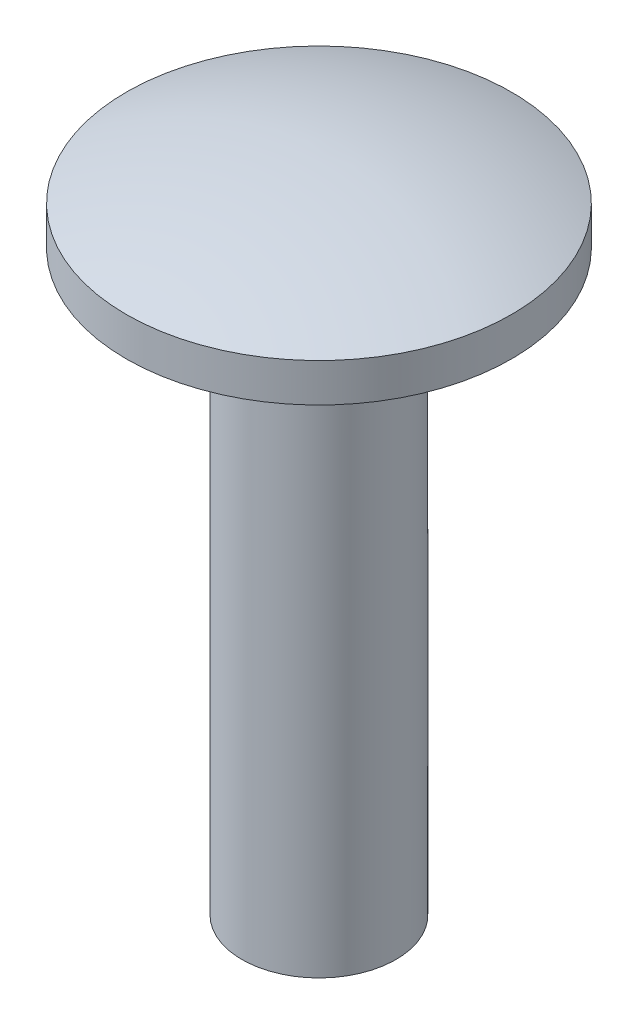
ISO-10303-21;
HEADER;
FILE_DESCRIPTION(('STEP AP214'),'2;1');
FILE_NAME('part.step','',(''),(''),'','','');
FILE_SCHEMA(('AUTOMOTIVE_DESIGN { 1 0 10303 214 1 1 1 1 }'));
ENDSEC;
DATA;
#1=APPLICATION_CONTEXT('core data for automotive mechanical design processes');
#2=APPLICATION_PROTOCOL_DEFINITION('international standard','automotive_design',2000,#1);
#3=PRODUCT_CONTEXT('',#1,'mechanical');
#4=PRODUCT('Part','Part','',(#3));
#5=PRODUCT_RELATED_PRODUCT_CATEGORY('part','',(#4));
#6=PRODUCT_DEFINITION_FORMATION('','',#4);
#7=PRODUCT_DEFINITION_CONTEXT('part definition',#1,'design');
#8=PRODUCT_DEFINITION('design','',#6,#7);
#9=PRODUCT_DEFINITION_SHAPE('','',#8);
#10=(LENGTH_UNIT() NAMED_UNIT(*) SI_UNIT(.MILLI.,.METRE.));
#11=(NAMED_UNIT(*) PLANE_ANGLE_UNIT() SI_UNIT($,.RADIAN.));
#12=(NAMED_UNIT(*) SI_UNIT($,.STERADIAN.) SOLID_ANGLE_UNIT());
#13=UNCERTAINTY_MEASURE_WITH_UNIT(LENGTH_MEASURE(1.E-05),#10,'distance_accuracy_value','');
#14=(GEOMETRIC_REPRESENTATION_CONTEXT(3) GLOBAL_UNCERTAINTY_ASSIGNED_CONTEXT((#13)) GLOBAL_UNIT_ASSIGNED_CONTEXT((#10,
#11,#12)) REPRESENTATION_CONTEXT('',''));
#15=CARTESIAN_POINT('',(0.,0.,0.));
#16=DIRECTION('',(0.,0.,1.));
#17=DIRECTION('',(1.,0.,0.));
#18=AXIS2_PLACEMENT_3D('',#15,#16,#17);
#19=CARTESIAN_POINT('',(0.,0.,0.));
#20=DIRECTION('',(0.,1.,0.));
#21=DIRECTION('',(0.,0.,1.));
#22=AXIS2_PLACEMENT_3D('',#19,#20,#21);
#23=PLANE('',#22);
#24=CARTESIAN_POINT('',(0.,0.,0.));
#25=DIRECTION('',(0.,1.,0.));
#26=DIRECTION('',(0.,0.,1.));
#27=AXIS2_PLACEMENT_3D('',#24,#25,#26);
#28=CIRCLE('',#27,2.);
#29=CARTESIAN_POINT('',(0.,0.,-2.));
#30=VERTEX_POINT('',#29);
#31=CARTESIAN_POINT('',(0.,0.,2.));
#32=VERTEX_POINT('',#31);
#33=EDGE_CURVE('E46',#30,#32,#28,.F.);
#34=ORIENTED_EDGE('',*,*,#33,.F.);
#35=EDGE_CURVE('E11',#32,#30,#28,.F.);
#36=ORIENTED_EDGE('',*,*,#35,.F.);
#37=EDGE_LOOP('',(#34,#36));
#38=FACE_BOUND('',#37,.T.);
#39=CARTESIAN_POINT('',(0.,0.,0.));
#40=DIRECTION('',(0.,1.,0.));
#41=DIRECTION('',(0.,0.,1.));
#42=AXIS2_PLACEMENT_3D('',#39,#40,#41);
#43=CIRCLE('',#42,5.);
#44=CARTESIAN_POINT('',(0.,0.,5.));
#45=VERTEX_POINT('',#44);
#46=EDGE_CURVE('E61',#45,#45,#43,.T.);
#47=ORIENTED_EDGE('',*,*,#46,.F.);
#48=EDGE_LOOP('',(#47));
#49=FACE_BOUND('',#48,.T.);
#50=ADVANCED_FACE('F33',(#38,#49),#23,.F.);
#51=CARTESIAN_POINT('',(0.,1.,0.));
#52=DIRECTION('',(0.,-1.,0.));
#53=DIRECTION('',(0.,0.,-1.));
#54=AXIS2_PLACEMENT_3D('',#51,#52,#53);
#55=CYLINDRICAL_SURFACE('',#54,5.);
#56=CARTESIAN_POINT('',(0.,1.,0.));
#57=DIRECTION('',(0.,1.,0.));
#58=DIRECTION('',(0.,0.,1.));
#59=AXIS2_PLACEMENT_3D('',#56,#57,#58);
#60=CIRCLE('',#59,5.);
#61=CARTESIAN_POINT('',(0.,1.,5.));
#62=VERTEX_POINT('',#61);
#63=EDGE_CURVE('E93',#62,#62,#60,.T.);
#64=ORIENTED_EDGE('',*,*,#63,.F.);
#65=EDGE_LOOP('',(#64));
#66=FACE_BOUND('',#65,.T.);
#67=ORIENTED_EDGE('',*,*,#46,.T.);
#68=EDGE_LOOP('',(#67));
#69=FACE_BOUND('',#68,.T.);
#70=ADVANCED_FACE('F82',(#66,#69),#55,.T.);
#71=CARTESIAN_POINT('',(0.,-11.,0.));
#72=DIRECTION('',(0.,0.,1.));
#73=DIRECTION('',(1.,0.,0.));
#74=AXIS2_PLACEMENT_3D('',#71,#72,#73);
#75=SPHERICAL_SURFACE('',#74,13.);
#76=CARTESIAN_POINT('',(0.,-11.,0.));
#77=DIRECTION('',(0.,1.,0.));
#78=DIRECTION('',(0.,0.,1.));
#79=AXIS2_PLACEMENT_3D('',#76,#77,#78);
#80=SPHERICAL_SURFACE('',#79,13.);
#81=ORIENTED_EDGE('',*,*,#63,.T.);
#82=EDGE_LOOP('',(#81));
#83=FACE_BOUND('',#82,.T.);
#84=ADVANCED_FACE('F35',(#83),#80,.T.);
#85=CARTESIAN_POINT('',(0.,-15.,0.));
#86=DIRECTION('',(0.,1.,0.));
#87=DIRECTION('',(0.,0.,1.));
#88=AXIS2_PLACEMENT_3D('',#85,#86,#87);
#89=CYLINDRICAL_SURFACE('',#88,2.);
#90=CARTESIAN_POINT('',(0.,-15.,0.));
#91=DIRECTION('',(0.,-1.,0.));
#92=DIRECTION('',(0.,0.,-1.));
#93=AXIS2_PLACEMENT_3D('',#90,#91,#92);
#94=CIRCLE('',#93,2.);
#95=CARTESIAN_POINT('',(0.,-15.,-2.));
#96=VERTEX_POINT('',#95);
#97=EDGE_CURVE('E59',#96,#96,#94,.T.);
#98=ORIENTED_EDGE('',*,*,#97,.F.);
#99=EDGE_LOOP('',(#98));
#100=FACE_BOUND('',#99,.T.);
#101=ORIENTED_EDGE('',*,*,#33,.T.);
#102=CARTESIAN_POINT('',(0.,0.,2.));
#103=CARTESIAN_POINT('',(0.0406175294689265,1.45115155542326E-06,2.00000108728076));
#104=CARTESIAN_POINT('',(0.0812251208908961,-0.00330988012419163,1.99875189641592));
#105=CARTESIAN_POINT('',(0.16122672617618,-0.016414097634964,1.99389348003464));
#106=CARTESIAN_POINT('',(0.200620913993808,-0.0262060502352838,1.99028459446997));
#107=CARTESIAN_POINT('',(0.277030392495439,-0.05187650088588,1.98109416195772));
#108=CARTESIAN_POINT('',(0.314050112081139,-0.0677432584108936,1.9755164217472));
#109=CARTESIAN_POINT('',(0.384899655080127,-0.10505320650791,1.96294383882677));
#110=CARTESIAN_POINT('',(0.41872861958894,-0.126497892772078,1.95594861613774));
#111=CARTESIAN_POINT('',(0.483673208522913,-0.175306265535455,1.94093123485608));
#112=CARTESIAN_POINT('',(0.514635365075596,-0.202865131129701,1.93288001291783));
#113=CARTESIAN_POINT('',(0.571622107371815,-0.262705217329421,1.91680110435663));
#114=CARTESIAN_POINT('',(0.597645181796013,-0.294987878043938,1.90877342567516));
#115=CARTESIAN_POINT('',(0.644991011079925,-0.364858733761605,1.89331235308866));
#116=CARTESIAN_POINT('',(0.666096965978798,-0.40260218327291,1.88591324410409));
#117=CARTESIAN_POINT('',(0.701593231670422,-0.481424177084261,1.87299930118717));
#118=CARTESIAN_POINT('',(0.715986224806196,-0.522501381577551,1.8674837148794));
#119=CARTESIAN_POINT('',(0.737042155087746,-0.6050583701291,1.85927206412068));
#120=CARTESIAN_POINT('',(0.743997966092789,-0.646452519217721,1.85646962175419));
#121=CARTESIAN_POINT('',(0.75089778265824,-0.729908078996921,1.85369030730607));
#122=CARTESIAN_POINT('',(0.750844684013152,-0.771969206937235,1.85371226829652));
#123=CARTESIAN_POINT('',(0.74395214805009,-0.852884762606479,1.85648755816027));
#124=CARTESIAN_POINT('',(0.737519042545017,-0.891780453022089,1.85907734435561));
#125=CARTESIAN_POINT('',(0.71872083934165,-0.967893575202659,1.86642469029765));
#126=CARTESIAN_POINT('',(0.706354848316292,-1.00511075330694,1.87118257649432));
#127=CARTESIAN_POINT('',(0.675818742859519,-1.07763853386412,1.88242851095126));
#128=CARTESIAN_POINT('',(0.657543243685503,-1.11289974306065,1.88894758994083));
#129=CARTESIAN_POINT('',(0.615780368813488,-1.17997286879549,1.9029710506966));
#130=CARTESIAN_POINT('',(0.592291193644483,-1.21178358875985,1.91047577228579));
#131=CARTESIAN_POINT('',(0.538908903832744,-1.27330183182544,1.92624019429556));
#132=CARTESIAN_POINT('',(0.508691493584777,-1.30272432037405,1.93451673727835));
#133=CARTESIAN_POINT('',(0.44365629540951,-1.3561689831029,1.95045864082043));
#134=CARTESIAN_POINT('',(0.408837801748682,-1.38019032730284,1.95812390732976));
#135=CARTESIAN_POINT('',(0.334861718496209,-1.42246519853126,1.9721319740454));
#136=CARTESIAN_POINT('',(0.295645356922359,-1.44062379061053,1.97845249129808));
#137=CARTESIAN_POINT('',(0.214418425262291,-1.46999130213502,1.98889359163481));
#138=CARTESIAN_POINT('',(0.172409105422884,-1.48120330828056,1.99301515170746));
#139=CARTESIAN_POINT('',(0.089187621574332,-1.49581139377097,1.99842221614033));
#140=CARTESIAN_POINT('',(0.0480518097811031,-1.49959130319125,1.99984684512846));
#141=CARTESIAN_POINT('',(-0.0342862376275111,-1.50034553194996,2.0001294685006));
#142=CARTESIAN_POINT('',(-0.0754884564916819,-1.4973213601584,1.99898803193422));
#143=CARTESIAN_POINT('',(-0.155131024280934,-1.48484497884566,1.99435854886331));
#144=CARTESIAN_POINT('',(-0.193616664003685,-1.47564422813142,1.99096235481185));
#145=CARTESIAN_POINT('',(-0.268470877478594,-1.45140696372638,1.98225738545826));
#146=CARTESIAN_POINT('',(-0.304839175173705,-1.43636969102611,1.97694836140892));
#147=CARTESIAN_POINT('',(-0.375623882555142,-1.40040679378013,1.96474812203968));
#148=CARTESIAN_POINT('',(-0.409951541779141,-1.37932113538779,1.95781500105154));
#149=CARTESIAN_POINT('',(-0.47469635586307,-1.33204094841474,1.94313335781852));
#150=CARTESIAN_POINT('',(-0.505112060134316,-1.30584453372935,1.93538453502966));
#151=CARTESIAN_POINT('',(-0.563015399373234,-1.24729793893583,1.91936664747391));
#152=CARTESIAN_POINT('',(-0.590230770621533,-1.21467890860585,1.91109348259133));
#153=CARTESIAN_POINT('',(-0.638855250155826,-1.14517430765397,1.89539407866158));
#154=CARTESIAN_POINT('',(-0.660263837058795,-1.10828835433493,1.88796791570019));
#155=CARTESIAN_POINT('',(-0.696688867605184,-1.03099200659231,1.87483414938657));
#156=CARTESIAN_POINT('',(-0.711678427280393,-0.990567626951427,1.86913380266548));
#157=CARTESIAN_POINT('',(-0.734539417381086,-0.907495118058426,1.86027016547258));
#158=CARTESIAN_POINT('',(-0.742415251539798,-0.864848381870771,1.85710530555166));
#159=CARTESIAN_POINT('',(-0.750431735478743,-0.781491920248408,1.85387947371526));
#160=CARTESIAN_POINT('',(-0.751036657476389,-0.740833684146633,1.85363222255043));
#161=CARTESIAN_POINT('',(-0.745683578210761,-0.660027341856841,1.85579206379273));
#162=CARTESIAN_POINT('',(-0.739726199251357,-0.619879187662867,1.858198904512));
#163=CARTESIAN_POINT('',(-0.721779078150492,-0.542476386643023,1.86524070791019));
#164=CARTESIAN_POINT('',(-0.709978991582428,-0.505170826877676,1.86980542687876));
#165=CARTESIAN_POINT('',(-0.68084848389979,-0.433047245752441,1.88060774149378));
#166=CARTESIAN_POINT('',(-0.663516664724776,-0.398229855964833,1.88684575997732));
#167=CARTESIAN_POINT('',(-0.622760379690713,-0.330086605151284,1.90069861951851));
#168=CARTESIAN_POINT('',(-0.599064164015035,-0.296934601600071,1.90836849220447));
#169=CARTESIAN_POINT('',(-0.546672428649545,-0.23492921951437,1.92403123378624));
#170=CARTESIAN_POINT('',(-0.517975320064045,-0.206077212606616,1.93202420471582));
#171=CARTESIAN_POINT('',(-0.454540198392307,-0.151899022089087,1.9479521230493));
#172=CARTESIAN_POINT('',(-0.419559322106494,-0.126848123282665,1.9558605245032));
#173=CARTESIAN_POINT('',(-0.345606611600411,-0.0829886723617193,1.97027257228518));
#174=CARTESIAN_POINT('',(-0.30663446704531,-0.0641806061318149,1.9767761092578));
#175=CARTESIAN_POINT('',(-0.223999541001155,-0.0328115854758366,1.98787146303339));
#176=CARTESIAN_POINT('',(-0.180206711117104,-0.0205564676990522,1.99236828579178));
#177=CARTESIAN_POINT('',(-0.0909378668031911,-0.00415352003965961,1.99843121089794));
#178=CARTESIAN_POINT('',(-0.0454627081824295,-1.62425633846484E-06,1.99999878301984));
#179=CARTESIAN_POINT('',(0.,0.,2.));
#180=B_SPLINE_CURVE_WITH_KNOTS('',3,(#102,#103,#104,#105,#106,#107,#108,#109,#110,#111,#112,
#113,#114,#115,#116,#117,#118,#119,#120,#121,#122,#123,#124,#125,#126,#127,#128,#129,#130,#131,
#132,#133,#134,#135,#136,#137,#138,#139,#140,#141,#142,#143,#144,#145,#146,#147,#148,#149,#150,
#151,#152,#153,#154,#155,#156,#157,#158,#159,#160,#161,#162,#163,#164,#165,#166,#167,#168,#169,
#170,#171,#172,#173,#174,#175,#176,#177,#178,#179),.UNSPECIFIED.,.T.,.F.,(4,2,2,2,2,2,2,2,2,2,2,
2,2,2,2,2,2,2,2,2,2,2,2,2,2,2,2,2,2,2,2,2,2,2,2,2,2,2,4),(0.,0.12168490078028,0.24335227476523,
0.364785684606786,0.486251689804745,0.612368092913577,0.738523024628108,0.869483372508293,
1.00039134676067,1.12592937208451,1.25141553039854,1.36939172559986,1.48738569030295,
1.60761204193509,1.72787995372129,1.85623076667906,1.98460128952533,2.11495687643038,
2.24525449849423,2.36862509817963,2.4919683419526,2.6105721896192,2.72919146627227,
2.851296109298,2.97344590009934,3.10268259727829,3.2319308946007,3.36171533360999,
3.49141937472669,3.61279381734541,3.73415675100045,3.85181571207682,3.96950443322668,
4.09336235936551,4.21725970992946,4.34786164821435,4.47847374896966,4.61474257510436,
4.75094300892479),.UNSPECIFIED.);
#181=EDGE_CURVE('E37',#32,#32,#180,.T.);
#182=ORIENTED_EDGE('',*,*,#181,.T.);
#183=ORIENTED_EDGE('',*,*,#35,.T.);
#184=CARTESIAN_POINT('',(0.,0.,-2.));
#185=CARTESIAN_POINT('',(-0.0406175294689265,1.45115155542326E-06,-2.00000108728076));
#186=CARTESIAN_POINT('',(-0.0812251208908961,-0.00330988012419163,-1.99875189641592));
#187=CARTESIAN_POINT('',(-0.16122672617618,-0.016414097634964,-1.99389348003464));
#188=CARTESIAN_POINT('',(-0.200620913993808,-0.0262060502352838,-1.99028459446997));
#189=CARTESIAN_POINT('',(-0.277030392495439,-0.05187650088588,-1.98109416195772));
#190=CARTESIAN_POINT('',(-0.314050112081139,-0.0677432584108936,-1.9755164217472));
#191=CARTESIAN_POINT('',(-0.384899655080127,-0.10505320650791,-1.96294383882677));
#192=CARTESIAN_POINT('',(-0.41872861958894,-0.126497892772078,-1.95594861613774));
#193=CARTESIAN_POINT('',(-0.483673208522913,-0.175306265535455,-1.94093123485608));
#194=CARTESIAN_POINT('',(-0.514635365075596,-0.202865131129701,-1.93288001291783));
#195=CARTESIAN_POINT('',(-0.571622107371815,-0.262705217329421,-1.91680110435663));
#196=CARTESIAN_POINT('',(-0.597645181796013,-0.294987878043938,-1.90877342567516));
#197=CARTESIAN_POINT('',(-0.644991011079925,-0.364858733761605,-1.89331235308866));
#198=CARTESIAN_POINT('',(-0.666096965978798,-0.40260218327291,-1.88591324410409));
#199=CARTESIAN_POINT('',(-0.701593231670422,-0.481424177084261,-1.87299930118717));
#200=CARTESIAN_POINT('',(-0.715986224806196,-0.522501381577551,-1.8674837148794));
#201=CARTESIAN_POINT('',(-0.737042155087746,-0.6050583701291,-1.85927206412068));
#202=CARTESIAN_POINT('',(-0.743997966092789,-0.646452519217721,-1.85646962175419));
#203=CARTESIAN_POINT('',(-0.75089778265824,-0.729908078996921,-1.85369030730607));
#204=CARTESIAN_POINT('',(-0.750844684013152,-0.771969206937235,-1.85371226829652));
#205=CARTESIAN_POINT('',(-0.74395214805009,-0.852884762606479,-1.85648755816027));
#206=CARTESIAN_POINT('',(-0.737519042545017,-0.891780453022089,-1.85907734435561));
#207=CARTESIAN_POINT('',(-0.71872083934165,-0.967893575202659,-1.86642469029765));
#208=CARTESIAN_POINT('',(-0.706354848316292,-1.00511075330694,-1.87118257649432));
#209=CARTESIAN_POINT('',(-0.675818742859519,-1.07763853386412,-1.88242851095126));
#210=CARTESIAN_POINT('',(-0.657543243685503,-1.11289974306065,-1.88894758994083));
#211=CARTESIAN_POINT('',(-0.615780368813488,-1.17997286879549,-1.9029710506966));
#212=CARTESIAN_POINT('',(-0.592291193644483,-1.21178358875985,-1.91047577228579));
#213=CARTESIAN_POINT('',(-0.538908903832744,-1.27330183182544,-1.92624019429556));
#214=CARTESIAN_POINT('',(-0.508691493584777,-1.30272432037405,-1.93451673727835));
#215=CARTESIAN_POINT('',(-0.44365629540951,-1.3561689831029,-1.95045864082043));
#216=CARTESIAN_POINT('',(-0.408837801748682,-1.38019032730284,-1.95812390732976));
#217=CARTESIAN_POINT('',(-0.334861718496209,-1.42246519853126,-1.9721319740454));
#218=CARTESIAN_POINT('',(-0.295645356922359,-1.44062379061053,-1.97845249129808));
#219=CARTESIAN_POINT('',(-0.214418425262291,-1.46999130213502,-1.98889359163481));
#220=CARTESIAN_POINT('',(-0.172409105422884,-1.48120330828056,-1.99301515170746));
#221=CARTESIAN_POINT('',(-0.089187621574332,-1.49581139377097,-1.99842221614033));
#222=CARTESIAN_POINT('',(-0.0480518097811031,-1.49959130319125,-1.99984684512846));
#223=CARTESIAN_POINT('',(0.0342862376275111,-1.50034553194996,-2.0001294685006));
#224=CARTESIAN_POINT('',(0.0754884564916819,-1.4973213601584,-1.99898803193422));
#225=CARTESIAN_POINT('',(0.155131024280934,-1.48484497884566,-1.99435854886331));
#226=CARTESIAN_POINT('',(0.193616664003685,-1.47564422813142,-1.99096235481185));
#227=CARTESIAN_POINT('',(0.268470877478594,-1.45140696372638,-1.98225738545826));
#228=CARTESIAN_POINT('',(0.304839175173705,-1.43636969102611,-1.97694836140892));
#229=CARTESIAN_POINT('',(0.375623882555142,-1.40040679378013,-1.96474812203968));
#230=CARTESIAN_POINT('',(0.409951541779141,-1.37932113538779,-1.95781500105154));
#231=CARTESIAN_POINT('',(0.47469635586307,-1.33204094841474,-1.94313335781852));
#232=CARTESIAN_POINT('',(0.505112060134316,-1.30584453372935,-1.93538453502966));
#233=CARTESIAN_POINT('',(0.563015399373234,-1.24729793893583,-1.91936664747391));
#234=CARTESIAN_POINT('',(0.590230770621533,-1.21467890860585,-1.91109348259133));
#235=CARTESIAN_POINT('',(0.638855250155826,-1.14517430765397,-1.89539407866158));
#236=CARTESIAN_POINT('',(0.660263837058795,-1.10828835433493,-1.88796791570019));
#237=CARTESIAN_POINT('',(0.696688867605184,-1.03099200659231,-1.87483414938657));
#238=CARTESIAN_POINT('',(0.711678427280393,-0.990567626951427,-1.86913380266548));
#239=CARTESIAN_POINT('',(0.734539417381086,-0.907495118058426,-1.86027016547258));
#240=CARTESIAN_POINT('',(0.742415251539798,-0.864848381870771,-1.85710530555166));
#241=CARTESIAN_POINT('',(0.750431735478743,-0.781491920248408,-1.85387947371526));
#242=CARTESIAN_POINT('',(0.751036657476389,-0.740833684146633,-1.85363222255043));
#243=CARTESIAN_POINT('',(0.745683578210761,-0.660027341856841,-1.85579206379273));
#244=CARTESIAN_POINT('',(0.739726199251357,-0.619879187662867,-1.858198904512));
#245=CARTESIAN_POINT('',(0.721779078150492,-0.542476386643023,-1.86524070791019));
#246=CARTESIAN_POINT('',(0.709978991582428,-0.505170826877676,-1.86980542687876));
#247=CARTESIAN_POINT('',(0.68084848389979,-0.433047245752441,-1.88060774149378));
#248=CARTESIAN_POINT('',(0.663516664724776,-0.398229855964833,-1.88684575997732));
#249=CARTESIAN_POINT('',(0.622760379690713,-0.330086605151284,-1.90069861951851));
#250=CARTESIAN_POINT('',(0.599064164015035,-0.296934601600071,-1.90836849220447));
#251=CARTESIAN_POINT('',(0.546672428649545,-0.23492921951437,-1.92403123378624));
#252=CARTESIAN_POINT('',(0.517975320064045,-0.206077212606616,-1.93202420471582));
#253=CARTESIAN_POINT('',(0.454540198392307,-0.151899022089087,-1.9479521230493));
#254=CARTESIAN_POINT('',(0.419559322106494,-0.126848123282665,-1.9558605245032));
#255=CARTESIAN_POINT('',(0.345606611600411,-0.0829886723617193,-1.97027257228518));
#256=CARTESIAN_POINT('',(0.30663446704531,-0.0641806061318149,-1.9767761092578));
#257=CARTESIAN_POINT('',(0.223999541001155,-0.0328115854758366,-1.98787146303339));
#258=CARTESIAN_POINT('',(0.180206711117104,-0.0205564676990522,-1.99236828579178));
#259=CARTESIAN_POINT('',(0.0909378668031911,-0.00415352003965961,-1.99843121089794));
#260=CARTESIAN_POINT('',(0.0454627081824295,-1.62425633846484E-06,-1.99999878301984));
#261=CARTESIAN_POINT('',(0.,0.,-2.));
#262=B_SPLINE_CURVE_WITH_KNOTS('',3,(#184,#185,#186,#187,#188,#189,#190,#191,#192,#193,#194,
#195,#196,#197,#198,#199,#200,#201,#202,#203,#204,#205,#206,#207,#208,#209,#210,#211,#212,#213,
#214,#215,#216,#217,#218,#219,#220,#221,#222,#223,#224,#225,#226,#227,#228,#229,#230,#231,#232,
#233,#234,#235,#236,#237,#238,#239,#240,#241,#242,#243,#244,#245,#246,#247,#248,#249,#250,#251,
#252,#253,#254,#255,#256,#257,#258,#259,#260,#261),.UNSPECIFIED.,.T.,.F.,(4,2,2,2,2,2,2,2,2,2,2,
2,2,2,2,2,2,2,2,2,2,2,2,2,2,2,2,2,2,2,2,2,2,2,2,2,2,2,4),(0.,0.12168490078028,0.24335227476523,
0.364785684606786,0.486251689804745,0.612368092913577,0.738523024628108,0.869483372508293,
1.00039134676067,1.12592937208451,1.25141553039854,1.36939172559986,1.48738569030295,
1.60761204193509,1.72787995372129,1.85623076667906,1.98460128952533,2.11495687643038,
2.24525449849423,2.36862509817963,2.4919683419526,2.6105721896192,2.72919146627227,
2.851296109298,2.97344590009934,3.10268259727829,3.2319308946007,3.36171533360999,
3.49141937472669,3.61279381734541,3.73415675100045,3.85181571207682,3.96950443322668,
4.09336235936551,4.21725970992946,4.34786164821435,4.47847374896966,4.61474257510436,
4.75094300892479),.UNSPECIFIED.);
#263=EDGE_CURVE('E52',#30,#30,#262,.T.);
#264=ORIENTED_EDGE('',*,*,#263,.T.);
#265=EDGE_LOOP('',(#101,#182,#183,#264));
#266=FACE_BOUND('',#265,.T.);
#267=ADVANCED_FACE('F67',(#100,#266),#89,.T.);
#268=CARTESIAN_POINT('',(0.,-15.,0.));
#269=DIRECTION('',(0.,-1.,0.));
#270=DIRECTION('',(0.,0.,-1.));
#271=AXIS2_PLACEMENT_3D('',#268,#269,#270);
#272=PLANE('',#271);
#273=ORIENTED_EDGE('',*,*,#97,.T.);
#274=EDGE_LOOP('',(#273));
#275=FACE_BOUND('',#274,.T.);
#276=ADVANCED_FACE('F73',(#275),#272,.T.);
#277=CARTESIAN_POINT('',(0.,-0.75,-5.));
#278=DIRECTION('',(0.,0.,1.));
#279=DIRECTION('',(1.,0.,0.));
#280=AXIS2_PLACEMENT_3D('',#277,#278,#279);
#281=CYLINDRICAL_SURFACE('',#280,0.75);
#282=ORIENTED_EDGE('',*,*,#263,.F.);
#283=EDGE_LOOP('',(#282));
#284=FACE_BOUND('',#283,.T.);
#285=ORIENTED_EDGE('',*,*,#181,.F.);
#286=EDGE_LOOP('',(#285));
#287=FACE_BOUND('',#286,.T.);
#288=ADVANCED_FACE('F56',(#284,#287),#281,.F.);
#289=CLOSED_SHELL('',(#50,#70,#84,#267,#276,#288));
#290=MANIFOLD_SOLID_BREP('B2',#289);
#291=ADVANCED_BREP_SHAPE_REPRESENTATION('',(#18,#290),#14);
#292=SHAPE_DEFINITION_REPRESENTATION(#9,#291);
ENDSEC;
END-ISO-10303-21;
